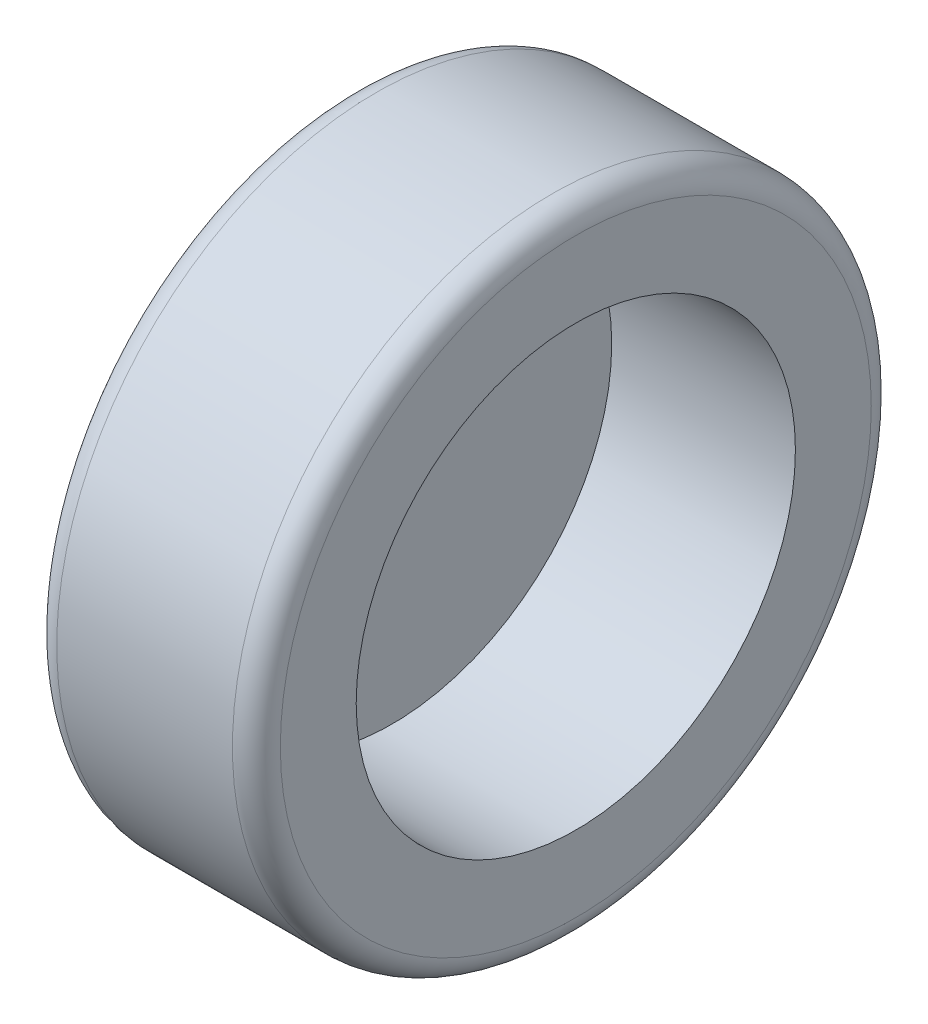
from build123d import *

# Parameters (mm, degrees)
ESQUISSE1_R        = 400
ESQUISSE1_R_2      = 275
BOSS_EXTRU_1_DEPTH = 140
ESQUISSE3_R        = 326.99558085
ESQUISSE3_R_2      = 5
BOSS_EXTRU_3_DEPTH = 50
CONG_1_R           = 30


with BuildPart() as part:
    # Esquisse1 → Boss.-Extru.1 (new, symmetric)
    with BuildSketch(Plane(origin=(0, 0, 0), x_dir=(0, 0, -1), z_dir=(1, 0, 0))):
        Circle(ESQUISSE1_R)
        Circle(ESQUISSE1_R_2, mode=Mode.SUBTRACT)
    extrude(amount=BOSS_EXTRU_1_DEPTH, both=True)

    # Esquisse3 → Boss.-Extru.3 (add)
    with BuildSketch(Plane.ZY.offset(140)):
        Circle(ESQUISSE3_R)
        Circle(ESQUISSE3_R_2, mode=Mode.SUBTRACT)
    extrude(amount=-BOSS_EXTRU_3_DEPTH)

    # Cong_1
    cong_1_edges = [part.edges().sort_by_distance(p)[0] for p in [
        (-140, 0, 400),
        (140, 0, 400),
    ]]
    fillet(cong_1_edges, radius=CONG_1_R)


solid = part.part
